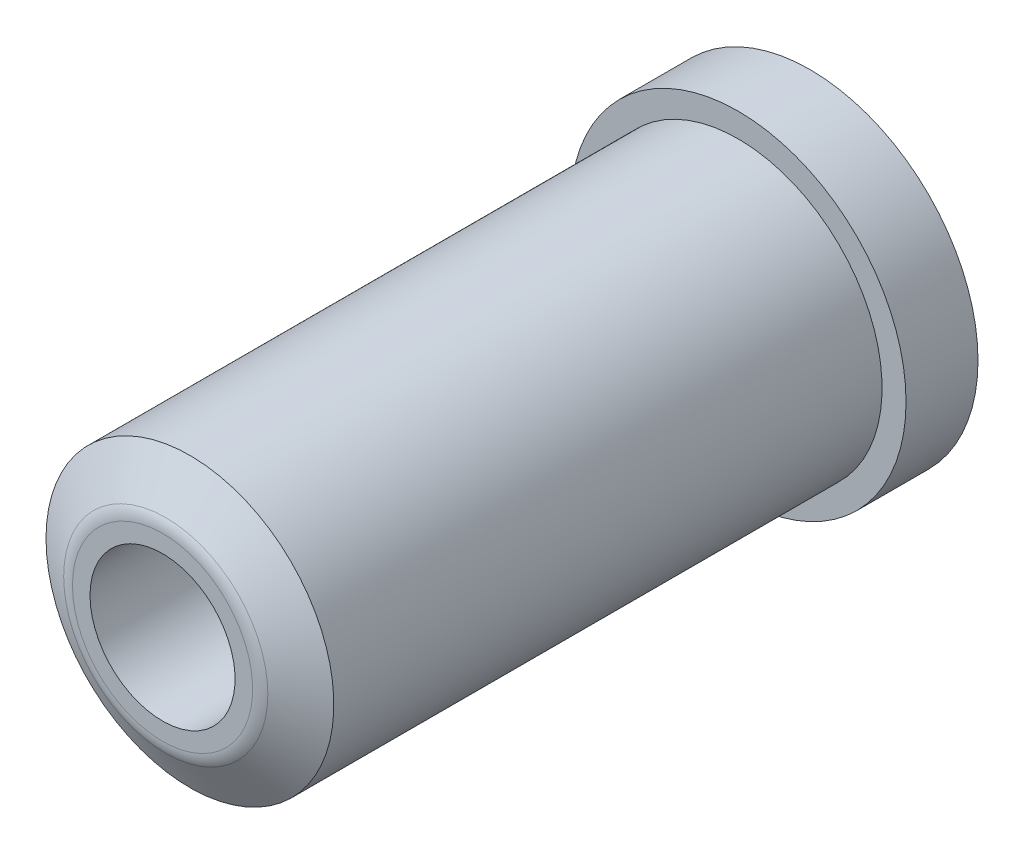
from build123d import *


with BuildPart() as part:
    # Logo3_bib1 → Revolve1 (revolve)
    with BuildSketch(Plane(origin=(0, 0, 0), x_dir=(-1, 0, 0), z_dir=(0, -1, 0))):
        with BuildLine():
            Line((4.8006, 0), (4.8006, -39.6875))
            Line((4.8006, -39.6875), (4.8006, -42.8625))
            Line((4.8006, -42.8625), (5.962730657, -42.8625))
            ThreePointArc((5.962730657, -42.8625), (6.373605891, -42.808407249), (6.756480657, -42.649815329))
            Line((6.756480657, -42.649815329), (9.525, -41.051409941))
            Line((9.525, -41.051409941), (9.525, -4.7625))
            Line((9.525, -4.7625), (11.1125, -4.7625))
            Line((11.1125, -4.7625), (11.1125, 0))
            Line((11.1125, 0), (4.8006, 0))
        make_face()
    revolve(axis=Axis((0, 0, -41.537203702), (0, 0, 1)))


solid = part.part
